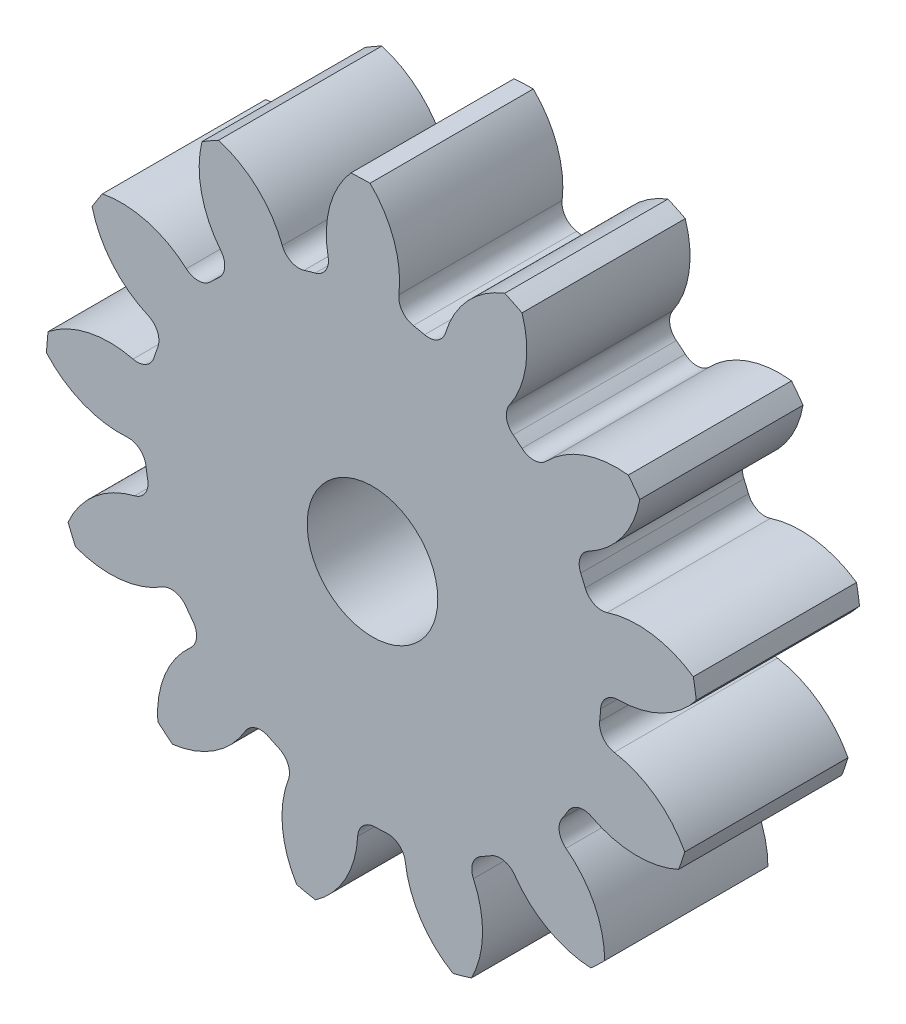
from build123d import *

# Parameters (mm, degrees)
SKETCH3_R         = 254
GEARBODY_DEPTH    = 127
TOOTHCUT_DEPTH    = 382
CIRPATTERN1_COUNT = 13
BOREDIA_R         = 50.8
BORE_DEPTH        = 12700


with BuildPart() as part:
    # Sketch3 → gearBody (new body)
    with BuildSketch(Plane.XY):
        Circle(SKETCH3_R)
    extrude(amount=GEARBODY_DEPTH)

    # Sketch2 → toothCut (cut, through all)
    with BuildSketch(Plane.XY):
        with BuildLine():
            ThreePointArc((176.742455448, -19.36348218), (177.173103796, -14.917482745), (177.491929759, -10.462068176))
            ThreePointArc((177.491929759, -10.462068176), (181.788536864, -1.25123512), (191.230409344, 2.510589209))
            ThreePointArc((191.230409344, 2.510589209), (226.634934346, 11.239059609), (254, 35.33926226))
            ThreePointArc((254, 35.33926226), (255.542416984, -21.515961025), (244.515006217, -77.312839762))
            ThreePointArc((244.515006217, -77.312839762), (221.564973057, -48.976245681), (188.118371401, -34.450701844))
            ThreePointArc((188.118371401, -34.450701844), (179.438437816, -29.163071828), (176.742455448, -19.36348218))
        make_face()
    toothcut = extrude(amount=TOOTHCUT_DEPTH, mode=Mode.SUBTRACT)

    # CirPattern1: toothCut ×13 about axis
    cirpattern1_axis = Axis((0, 0, 0), (0, 0, 1))
    for i in range(1, CIRPATTERN1_COUNT):
        add(toothcut.rotate(cirpattern1_axis, i * 360 / CIRPATTERN1_COUNT), mode=Mode.SUBTRACT)

    # boreDia → bore (cut, symmetric)
    with BuildSketch(Plane.XY):
        Circle(BOREDIA_R)
    extrude(amount=BORE_DEPTH, both=True, mode=Mode.SUBTRACT)


solid = part.part
